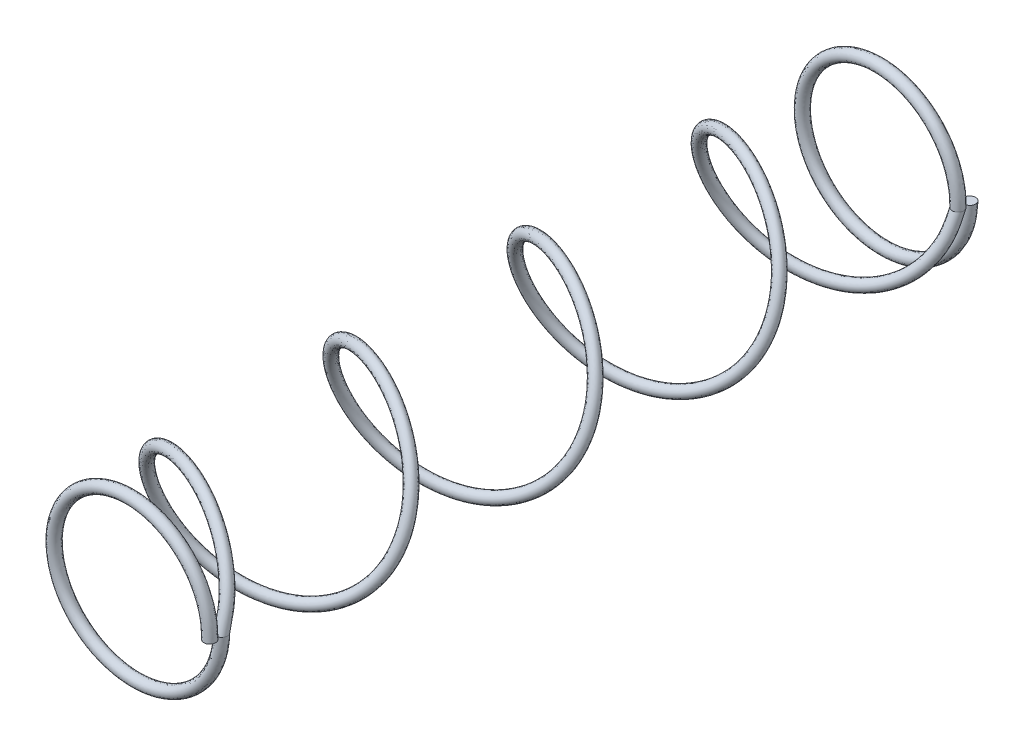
from build123d import *

# Parameters (mm, degrees)
DU_FIL_R                  = 1.1
SPIRE_PLATE_1_PITCH       = 2.25
SPIRE_PLATE_1_HEIGHT      = 2.25
SPIRE_PLATE_1_RADIUS      = 15.35
SPIRE_PLATE_1_START_ANGLE = 180
FIL_R                     = 1.1
ESQUISSE7_R               = 1.099999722


with BuildPart() as part:
    # Corps central: sweep along a curve in space
    with BuildLine() as corps_central_path:
        add(Edge.make_bspline(
            [(15.35, 0, 0), (15.35, -1.802869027, 0.654250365), (14.702141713, -5.436943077, 1.97323565), (11.907281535, -10.191563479, 3.943285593), (7.635912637, -13.688402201, 5.915593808), (2.417686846, -15.486270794, 7.887296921), (-3.100333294, -15.364263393, 9.85916217), (-8.233910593, -13.336964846, 11.830983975), (-12.34647896, -9.655906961, 13.802817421), (-14.928077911, -4.777503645, 15.774647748), (-15.658587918, 0.693310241, 17.746478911), (-14.447425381, 6.078153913, 19.718309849), (-11.444775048, 10.709303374, 21.690140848), (-7.022967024, 14.012494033, 23.66197183), (-1.730307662, 15.578128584, 25.633802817), (3.776910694, 15.212067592, 27.605633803), (8.815790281, 12.959702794, 29.577464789), (12.761507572, 9.100328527, 31.549295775), (15.124791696, 4.112509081, 33.521126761), (15.61259427, -1.385263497, 35.492957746), (14.164427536, -6.711262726, 37.464788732), (10.959864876, -11.205062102, 39.436619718), (6.396273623, -14.309428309, 41.408450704), (1.03954132, -15.639418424, 43.38028169), (-4.446094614, -15.030113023, 45.352112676), (-9.380412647, -12.557066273, 47.323943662), (-13.151554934, -8.526937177, 49.295774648), (-15.291897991, -3.439463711, 51.267605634), (-15.536038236, 2.074504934, 53.23943662), (-13.853702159, 7.331233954, 55.211267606), (-10.453500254, 11.678886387, 57.183098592), (-5.757059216, 14.578351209, 59.154929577), (-0.346740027, 15.670093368, 61.126760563), (5.106575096, 14.818736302, 63.098591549), (9.926672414, 12.129848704, 65.070422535), (13.515857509, 7.936853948, 67.042253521), (15.429069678, 2.759685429, 69.014084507), (15.429069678, -2.759685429, 70.985915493), (13.515857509, -7.936853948, 72.957746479), (9.926672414, -12.129848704, 74.929577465), (5.106575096, -14.818736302, 76.901408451), (-0.346740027, -15.670093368, 78.873239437), (-5.757059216, -14.578351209, 80.845070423), (-10.453500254, -11.678886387, 82.816901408), (-13.853702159, -7.331233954, 84.788732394), (-15.536038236, -2.074504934, 86.76056338), (-15.291897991, 3.439463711, 88.732394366), (-13.151554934, 8.526937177, 90.704225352), (-9.380412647, 12.557066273, 92.676056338), (-4.446094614, 15.030113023, 94.647887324), (1.03954132, 15.639418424, 96.61971831), (6.396273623, 14.309428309, 98.591549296), (10.959864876, 11.205062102, 100.563380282), (14.164427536, 6.711262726, 102.535211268), (15.61259427, 1.385263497, 104.507042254), (15.124791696, -4.112509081, 106.478873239), (12.761507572, -9.100328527, 108.450704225), (8.815790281, -12.959702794, 110.422535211), (3.776910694, -15.212067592, 112.394366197), (-1.730307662, -15.578128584, 114.366197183), (-7.022967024, -14.012494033, 116.33802817), (-11.444775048, -10.709303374, 118.309859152), (-14.447425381, -6.078153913, 120.281690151), (-15.658587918, -0.693310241, 122.253521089), (-14.928077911, 4.777503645, 124.225352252), (-12.34647896, 9.655906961, 126.197182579), (-8.233910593, 13.336964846, 128.169016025), (-3.100333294, 15.364263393, 130.14083783), (2.417686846, 15.486270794, 132.112703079), (7.635912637, 13.688402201, 134.084406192), (11.907281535, 10.191563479, 136.056714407), (14.702141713, 5.436943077, 138.02676435), (15.35, 1.802869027, 139.345749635), (15.35, 0, 140)],
            knots=[0, 0, 0, 0, 0.014084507, 0.028169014, 0.042253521, 0.056338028, 0.070422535, 0.084507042, 0.098591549, 0.112676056, 0.126760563, 0.14084507, 0.154929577, 0.169014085, 0.183098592, 0.197183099, 0.211267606, 0.225352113, 0.23943662, 0.253521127, 0.267605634, 0.281690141, 0.295774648, 0.309859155, 0.323943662, 0.338028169, 0.352112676, 0.366197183, 0.38028169, 0.394366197, 0.408450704, 0.422535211, 0.436619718, 0.450704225, 0.464788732, 0.478873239, 0.492957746, 0.507042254, 0.521126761, 0.535211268, 0.549295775, 0.563380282, 0.577464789, 0.591549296, 0.605633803, 0.61971831, 0.633802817, 0.647887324, 0.661971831, 0.676056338, 0.690140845, 0.704225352, 0.718309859, 0.732394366, 0.746478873, 0.76056338, 0.774647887, 0.788732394, 0.802816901, 0.816901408, 0.830985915, 0.845070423, 0.85915493, 0.873239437, 0.887323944, 0.901408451, 0.915492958, 0.929577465, 0.943661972, 0.957746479, 0.971830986, 0.985915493, 1, 1, 1, 1], degree=3))
    # du fil → Corps central (sweep)
    with BuildSketch(Plane(origin=(0, 0, 0), x_dir=(1, 0, 0), z_dir=(0, 1, 0))):
        with Locations((15.35, 0)):
            Circle(DU_FIL_R)
    sweep(path=corps_central_path.line, is_frenet=True)

    # Spire plate 1: sweep along a helix
    with BuildLine() as spire_plate_1_path:
        add(Helix(SPIRE_PLATE_1_PITCH, SPIRE_PLATE_1_HEIGHT, SPIRE_PLATE_1_RADIUS, center=(0, 0, 0), direction=(0, 0, -1), lefthand=True, mode=Mode.PRIVATE).rotate(Axis((0, 0, 0), (0, 0, -1)), SPIRE_PLATE_1_START_ANGLE))
    # fil → Spire plate 1 (sweep)
    with BuildSketch(Plane(origin=(0, 0, 0), x_dir=(-1, 0, 0), z_dir=(0, 1, 0))):
        with Locations((-15.35, 0)):
            Circle(FIL_R)
    sweep(path=spire_plate_1_path.line, is_frenet=True)

    # Spire plate 2: sweep along a curve in space
    with BuildLine() as spire_plate_2_path:
        add(Edge.make_bspline(
            [(15.35, 0, 143), (15.35, -1.880375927, 143.043867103), (14.643052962, -5.677640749, 143.132469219), (11.605006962, -10.578050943, 143.264674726), (6.999640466, -14.057524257, 143.397067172), (1.448933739, -15.636391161, 143.529409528), (-4.297459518, -15.104028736, 143.661765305), (-9.463457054, -12.53163563, 143.794117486), (-13.351362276, -8.266815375, 143.926470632), (-15.436092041, -2.885505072, 144.058823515), (-15.436092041, 2.885505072, 144.191176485), (-13.351362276, 8.266815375, 144.323529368), (-9.463457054, 12.53163563, 144.455882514), (-4.297459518, 15.104028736, 144.588234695), (1.448933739, 15.636391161, 144.720590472), (6.999640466, 14.057524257, 144.852932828), (11.605006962, 10.578050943, 144.985325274), (14.643052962, 5.677640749, 145.117530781), (15.35, 1.880375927, 145.206132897), (15.35, 0, 145.25)],
            knots=[0, 0, 0, 0, 0.058823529, 0.117647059, 0.176470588, 0.235294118, 0.294117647, 0.352941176, 0.411764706, 0.470588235, 0.529411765, 0.588235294, 0.647058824, 0.705882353, 0.764705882, 0.823529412, 0.882352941, 0.941176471, 1, 1, 1, 1], degree=3))
    # Esquisse7 → Spire plate 2 (sweep)
    with BuildSketch(Plane(origin=(6.13e-07, -0.003070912, 0), x_dir=(0.9999999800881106, 0.0001995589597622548, -4.76267432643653e-12), z_dir=(0.00019955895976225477, -0.9999999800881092, 5.486972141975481e-08))):
        with Locations((15.349999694, 140)):
            Circle(ESQUISSE7_R)
    sweep(path=spire_plate_2_path.line, is_frenet=True)


solid = part.part
